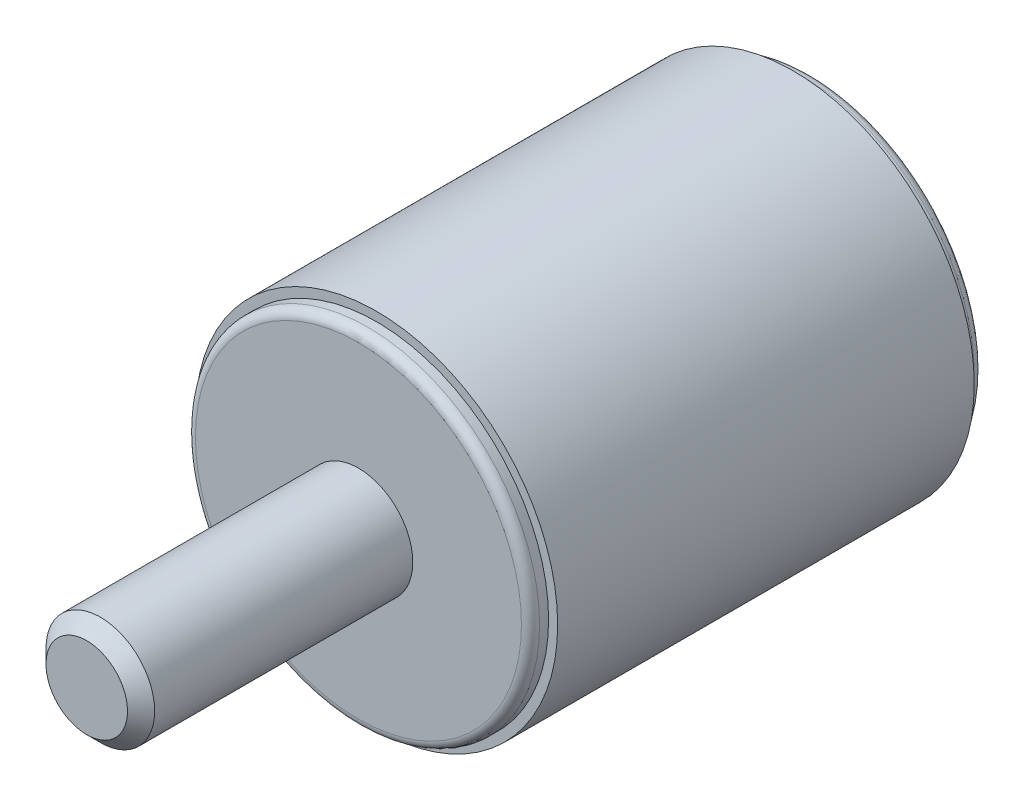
from build123d import *

# Parameters (mm, degrees)
ESQUISSE1_R             = 10
EXTRUSION1_DEPTH        = 23
ESQUISSE2_R             = 9.5
EXTRUSION2_DEPTH        = 1
EXTRUSION3_START        = 1
ESQUISSE3_R             = 9.5
EXTRUSION3_DEPTH        = 1
CONG_1_R                = 0.5
ESQUISSE4_R             = 3
EXTRUSION4_DEPTH        = 15
CHANFREIN1_SIZE         = 0.75
ESQUISSE5_R             = 3
ENL_V_MAT_EXTRU_1_DEPTH = 5


with BuildPart() as part:
    # Esquisse1 → Extrusion1 (new body)
    with BuildSketch(Plane.XY):
        Circle(ESQUISSE1_R)
    extrude(amount=EXTRUSION1_DEPTH)

    # Esquisse2 → Extrusion2 (add)
    with BuildSketch(Plane.XY.offset(23)):
        Circle(ESQUISSE2_R)
    extrude(amount=EXTRUSION2_DEPTH)

    # Esquisse3 → Extrusion3 (add)
    with BuildSketch(Plane(origin=(0, 0, 0), x_dir=(-1, 0, 0), z_dir=(0, 0, -1)).offset(EXTRUSION3_START)):
        with Locations(Location((0, 0, 0), (0, 0, 180))):
            Circle(ESQUISSE3_R)
    extrude(amount=-EXTRUSION3_DEPTH)

    # Cong_1
    cong_1_edges = [part.edges().sort_by_distance(p)[0] for p in [
        (-9.5, 0, -1),
        (-9.5, 0, 24),
    ]]
    fillet(cong_1_edges, radius=CONG_1_R)

    # Esquisse4 → Extrusion4 (add)
    with BuildSketch(Plane.XY.offset(24)):
        Circle(ESQUISSE4_R)
    extrude(amount=EXTRUSION4_DEPTH)

    # Chanfrein1
    chanfrein1_edges = [part.edges().sort_by_distance(p)[0] for p in [
        (-3, 0, 39),
    ]]
    chamfer(chanfrein1_edges, length=CHANFREIN1_SIZE)

    # Esquisse5 → Enl_v. mat.-Extru.1 (cut)
    with BuildSketch(Plane(origin=(0, 0, -1), x_dir=(-1, 0, 0), z_dir=(0, 0, -1))):
        with Locations(Location((0, 0, 0), (0, 0, 180))):
            Circle(ESQUISSE5_R)
    extrude(amount=-ENL_V_MAT_EXTRU_1_DEPTH, mode=Mode.SUBTRACT)

    # Esquisse9 → Enl_vement de mati_re-R_volution1 (revolve, cut)
    with BuildSketch(Plane(origin=(0, 0, 0), x_dir=(1, 0, 0), z_dir=(0, 1, 0))):
        Polygon((-3, -4), (0, -5.732050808), (0, -4), align=None)
    revolve(axis=Axis((0, 0, -2.324914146), (0, 0, 1)), mode=Mode.SUBTRACT)


solid = part.part
